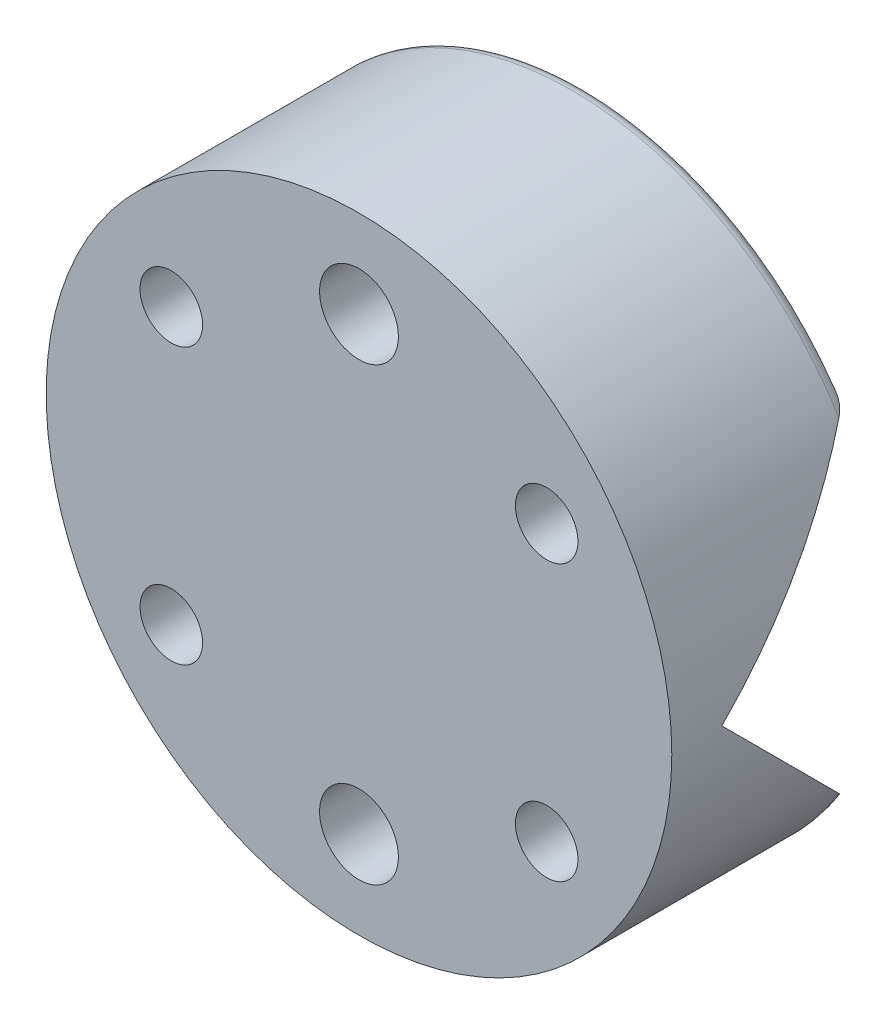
from build123d import *

# Parameters (mm, degrees)
ESQUISSE1_R              = 25
BASE_EXTRUSION_DEPTH     = 18
ENL_V_MAT_EXTRU_4_DEPTH  = 40.67366885
ENL_V_MAT_EXTRU_5_DEPTH  = 40.67366885
ESQUISSE10_R             = 2.5
ENL_V_MAT_EXTRU_8_DEPTH  = 10
ESQUISSE13_R             = 2.5
ENL_V_MAT_EXTRU_13_DEPTH = 10
ESQUISSE18_R             = 3.15
ENL_V_MAT_EXTRU_17_DEPTH = 40.67366885
CONG_1_R                 = 1


with BuildPart() as part:
    # Esquisse1 → Base-Extrusion (new body)
    with BuildSketch(Plane.XY):
        Circle(ESQUISSE1_R)
    extrude(amount=BASE_EXTRUSION_DEPTH)

    # Esquisse4 → Enl_v. mat.-Extru.4 (cut, through all)
    with BuildSketch(Plane(origin=(0, 0, 0), x_dir=(0, 0, -1), z_dir=(1, 0, 0))):
        Polygon((0, 14), (0, -14), (-14, 0), align=None)
    extrude(amount=-ENL_V_MAT_EXTRU_4_DEPTH, mode=Mode.SUBTRACT)

    # Esquisse5 → Enl_v. mat.-Extru.5 (cut, through all)
    with BuildSketch(Plane.ZY):
        Polygon((0, 14), (14, 0), (0, -14), align=None)
    extrude(amount=-ENL_V_MAT_EXTRU_5_DEPTH, mode=Mode.SUBTRACT)

    # Esquisse10 → Enl_v. mat.-Extru.8 (cut)
    with BuildSketch(Plane.XY.offset(18)):
        with Locations((15, 11)):
            Circle(ESQUISSE10_R)
    extrude(amount=-ENL_V_MAT_EXTRU_8_DEPTH, mode=Mode.SUBTRACT)

    # Enl_v. mat.-Extru.9 cone 1 section (on through the dimple's axis) → Enl_v. mat.-Extru.9 (revolve, cut)
    with BuildSketch(Plane(origin=(15, 11, 8), x_dir=(0, -1, 0), z_dir=(1, 0, 0))):
        Polygon((0, 0), (2.5, 0), (0, 1.443375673), align=None)
    revolve(axis=Axis((15, 11, 8), (0, 0, -1)), mode=Mode.SUBTRACT)

    # Esquisse13 → Enl_v. mat.-Extru.13 (cut)
    with BuildSketch(Plane.XY.offset(18)):
        with Locations((15, -11)):
            Circle(ESQUISSE13_R)
        with Locations((-15, 11)):
            Circle(ESQUISSE13_R)
        with Locations((-15, -11)):
            Circle(ESQUISSE13_R)
    extrude(amount=-ENL_V_MAT_EXTRU_13_DEPTH, mode=Mode.SUBTRACT)

    # Enl_v. mat.-Extru.14 cone 1 section (on through the dimple's axis) → Enl_v. mat.-Extru.14 (revolve, cut)
    with BuildSketch(Plane(origin=(-15, 11, 8), x_dir=(0, -1, 0), z_dir=(1, 0, 0))):
        Polygon((0, 0), (2.5, 0), (0, 1.443375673), align=None)
    revolve(axis=Axis((-15, 11, 8), (0, 0, -1)), mode=Mode.SUBTRACT)

    # Enl_v. mat.-Extru.15 cone 1 section (on through the dimple's axis) → Enl_v. mat.-Extru.15 (revolve, cut)
    with BuildSketch(Plane(origin=(-15, -11, 8), x_dir=(0, -1, 0), z_dir=(1, 0, 0))):
        Polygon((0, 0), (2.5, 0), (0, 1.443375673), align=None)
    revolve(axis=Axis((-15, -11, 8), (0, 0, -1)), mode=Mode.SUBTRACT)

    # Enl_v. mat.-Extru.16 cone 1 section (on through the dimple's axis) → Enl_v. mat.-Extru.16 (revolve, cut)
    with BuildSketch(Plane(origin=(15, -11, 8), x_dir=(0, -1, 0), z_dir=(1, 0, 0))):
        Polygon((0, 0), (2.5, 0), (0, 1.443375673), align=None)
    revolve(axis=Axis((15, -11, 8), (0, 0, -1)), mode=Mode.SUBTRACT)

    # Esquisse18 → Enl_v. mat.-Extru.17 (cut, through all)
    with BuildSketch(Plane.XY.offset(18)):
        with Locations((0, -18)):
            Circle(ESQUISSE18_R)
        with Locations((0, 18)):
            Circle(ESQUISSE18_R)
    extrude(amount=-ENL_V_MAT_EXTRU_17_DEPTH, mode=Mode.SUBTRACT)

    # Cong_1
    cong_1_edges = [part.edges().sort_by_distance(p)[0] for p in [
        (0, 25, 0),
        (0, -25, 0),
    ]]
    fillet(cong_1_edges, radius=CONG_1_R)


solid = part.part
